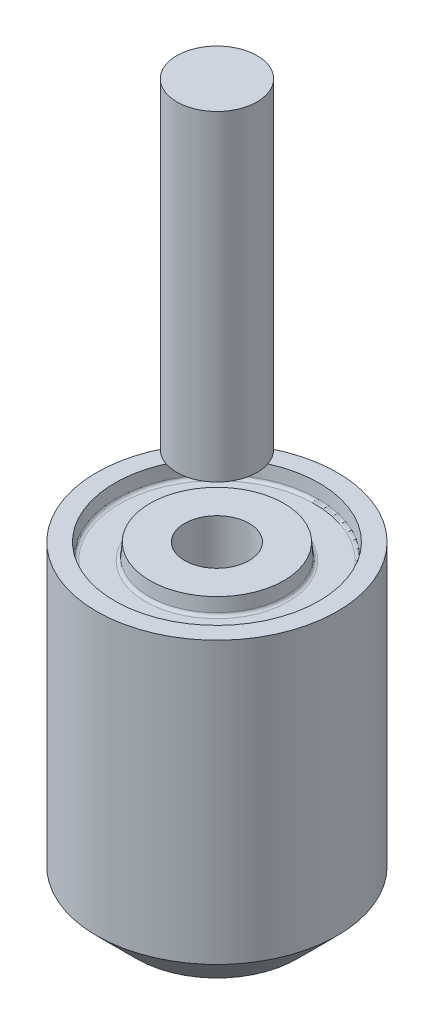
from build123d import *

# Parameters (mm, degrees)
SKETCH1_R                   = 9.525
EXTRUDE1_DEPTH              = 25.4
CHAMFER1_SIZE               = 3.175
F_1_4_20_TAPPED_HOLE1_D     = 5.1054
F_1_4_20_TAPPED_HOLE1_DEPTH = 17.3228
F_1_4_20_TAPPED_HOLE1_TIP   = 1.533816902
BRASSSTUD_93025A961_START   = 6.35
SKETCH15_R                  = 3.175
BRASSSTUD_93025A961_DEPTH   = 25.4


with BuildPart() as part:
    # Sketch1 → Extrude1 (new body)
    with BuildSketch(Plane(origin=(0, 0, 0), x_dir=(1, 0, 0), z_dir=(0, 1, 0))):
        with Locations(Location((0, 0, 0), (0, 0, 270))):
            Circle(SKETCH1_R)
    extrude(amount=-EXTRUDE1_DEPTH)

    # Chamfer1
    chamfer1_edges = [part.edges().sort_by_distance(p)[0] for p in [
        (0, -25.4, -9.525),
    ]]
    chamfer(chamfer1_edges, length=CHAMFER1_SIZE)

    # 1_4-20 Tapped Hole1
    with Locations(Plane(origin=(0, 0, 0), x_dir=(-1, 0, 0), z_dir=(0, 1, 0))):
        with Locations((0, 0)):
            Hole(F_1_4_20_TAPPED_HOLE1_D / 2, depth=F_1_4_20_TAPPED_HOLE1_DEPTH)
            with Locations((0, 0, -(F_1_4_20_TAPPED_HOLE1_DEPTH + F_1_4_20_TAPPED_HOLE1_TIP / 2))):  # 118° drill point
                Cone(0, F_1_4_20_TAPPED_HOLE1_D / 2, F_1_4_20_TAPPED_HOLE1_TIP, mode=Mode.SUBTRACT)

    # Sketch9 → Groove for AS 568-013_ O-Ring1 (revolve, cut)
    with BuildSketch(Plane.XY):
        with BuildLine():
            Line((5.389914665, -1.038137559), (5.299089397, 0))
            Line((5.299089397, 0), (8.086710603, 0))
            Line((8.086710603, 0), (7.995885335, -1.038137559))
            ThreePointArc((7.995885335, -1.038137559), (7.914451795, -1.203268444), (7.742851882, -1.27))
            Line((7.742851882, -1.27), (5.642948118, -1.27))
            ThreePointArc((5.642948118, -1.27), (5.471348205, -1.203268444), (5.389914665, -1.038137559))
        make_face()
    revolve(axis=Axis((0, 50, 0), (0, -1, 0)), mode=Mode.SUBTRACT)


with BuildPart() as body_2:
    # Sketch15 → BrassStud_93025A961 (new body)
    with BuildSketch(Plane(origin=(0, 0, 0), x_dir=(1, 0, 0), z_dir=(0, 1, 0)).offset(BRASSSTUD_93025A961_START)):
        with Locations(Location((0, 0, 0), (0, 0, 270))):
            Circle(SKETCH15_R)
    extrude(amount=BRASSSTUD_93025A961_DEPTH)


solid = Compound([part.part, body_2.part])
